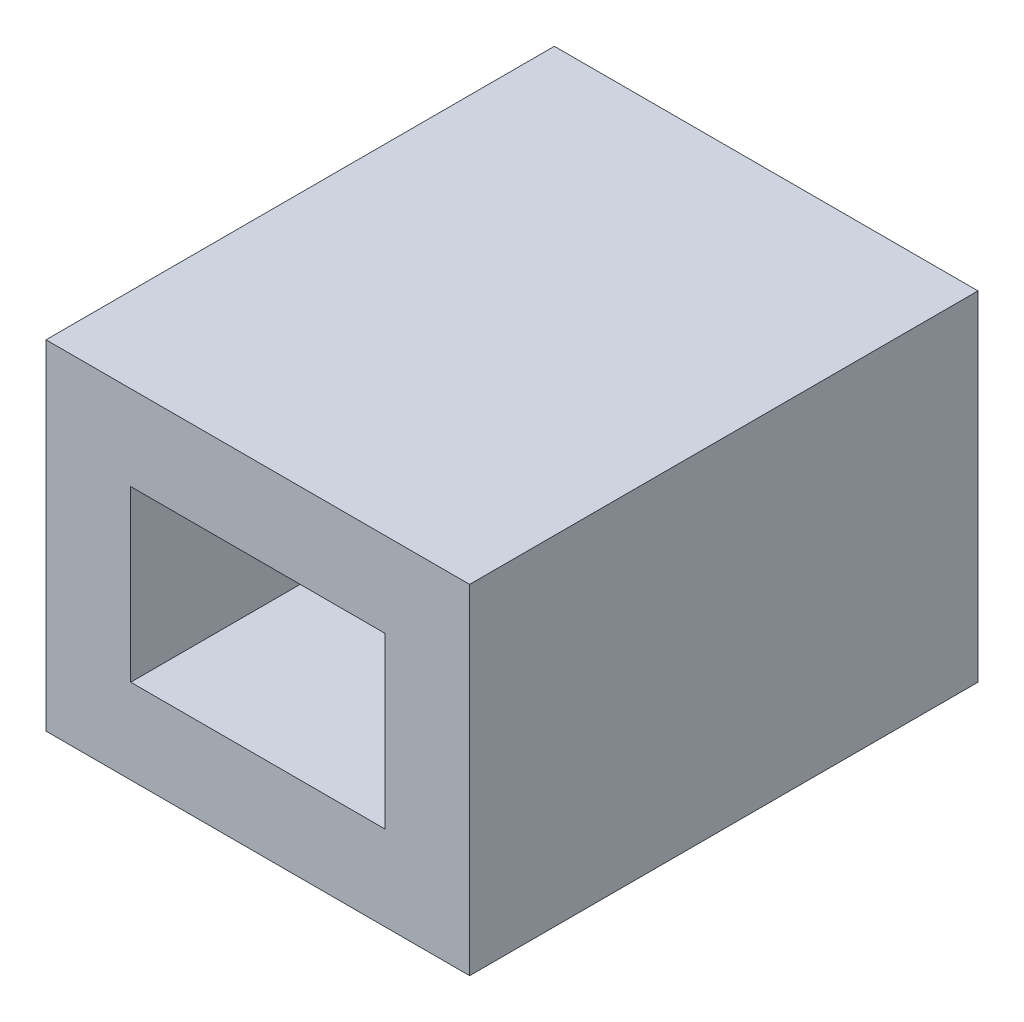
from build123d import *

# Parameters (mm, degrees)
SKETCH1_W      = 63.5
SKETCH1_H      = 50.8
SKETCH1_W_2    = 38.1
SKETCH1_H_2    = 25.4
EXTRUDE1_DEPTH = 76.2


with BuildPart() as part:
    # Sketch1 → Extrude1 (new body)
    with BuildSketch(Plane.XY):
        with Locations((-6.776967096, -9.038984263)):
            Rectangle(SKETCH1_W, SKETCH1_H)
        with Locations((-6.776967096, -9.038984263)):
            Rectangle(SKETCH1_W_2, SKETCH1_H_2, mode=Mode.SUBTRACT)
    extrude(amount=EXTRUDE1_DEPTH)


solid = part.part
